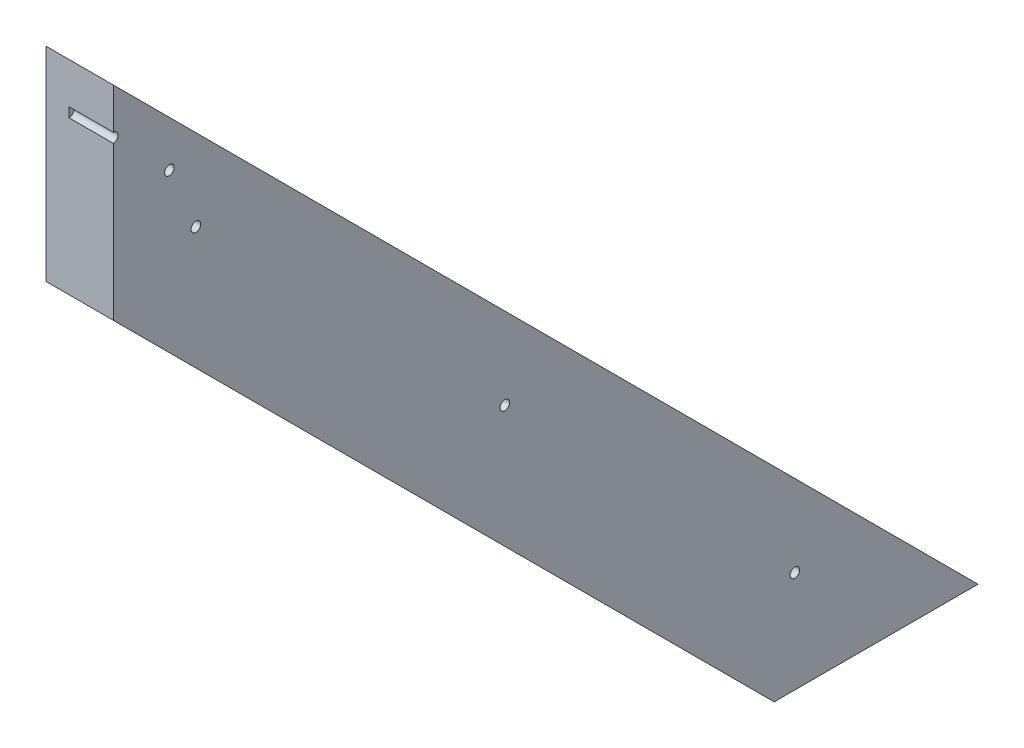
ISO-10303-21;
HEADER;
FILE_DESCRIPTION(('STEP AP214'),'2;1');
FILE_NAME('part.step','',(''),(''),'','','');
FILE_SCHEMA(('AUTOMOTIVE_DESIGN { 1 0 10303 214 1 1 1 1 }'));
ENDSEC;
DATA;
#1=APPLICATION_CONTEXT('core data for automotive mechanical design processes');
#2=APPLICATION_PROTOCOL_DEFINITION('international standard','automotive_design',2000,#1);
#3=PRODUCT_CONTEXT('',#1,'mechanical');
#4=PRODUCT('Part','Part','',(#3));
#5=PRODUCT_RELATED_PRODUCT_CATEGORY('part','',(#4));
#6=PRODUCT_DEFINITION_FORMATION('','',#4);
#7=PRODUCT_DEFINITION_CONTEXT('part definition',#1,'design');
#8=PRODUCT_DEFINITION('design','',#6,#7);
#9=PRODUCT_DEFINITION_SHAPE('','',#8);
#10=(LENGTH_UNIT() NAMED_UNIT(*) SI_UNIT(.MILLI.,.METRE.));
#11=(NAMED_UNIT(*) PLANE_ANGLE_UNIT() SI_UNIT($,.RADIAN.));
#12=(NAMED_UNIT(*) SI_UNIT($,.STERADIAN.) SOLID_ANGLE_UNIT());
#13=UNCERTAINTY_MEASURE_WITH_UNIT(LENGTH_MEASURE(1.E-05),#10,'distance_accuracy_value','');
#14=(GEOMETRIC_REPRESENTATION_CONTEXT(3) GLOBAL_UNCERTAINTY_ASSIGNED_CONTEXT((#13)) GLOBAL_UNIT_ASSIGNED_CONTEXT((#10,
#11,#12)) REPRESENTATION_CONTEXT('',''));
#15=CARTESIAN_POINT('',(0.,0.,0.));
#16=DIRECTION('',(0.,0.,1.));
#17=DIRECTION('',(1.,0.,0.));
#18=AXIS2_PLACEMENT_3D('',#15,#16,#17);
#19=CARTESIAN_POINT('',(-11.684,554.422308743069,-426.863096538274));
#20=DIRECTION('',(1.,0.,0.));
#21=DIRECTION('',(0.,0.,-1.));
#22=AXIS2_PLACEMENT_3D('',#19,#20,#21);
#23=PLANE('',#22);
#24=CARTESIAN_POINT('',(-11.684,554.422308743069,-426.863096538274));
#25=DIRECTION('',(1.,0.,0.));
#26=DIRECTION('',(0.,0.,-1.));
#27=AXIS2_PLACEMENT_3D('',#24,#25,#26);
#28=CIRCLE('',#27,1.26999999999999);
#29=CARTESIAN_POINT('',(-11.684,554.422308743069,-428.133096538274));
#30=VERTEX_POINT('',#29);
#31=EDGE_CURVE('E18',#30,#30,#28,.T.);
#32=ORIENTED_EDGE('',*,*,#31,.T.);
#33=EDGE_LOOP('',(#32));
#34=FACE_BOUND('',#33,.T.);
#35=ADVANCED_FACE('F15',(#34),#23,.T.);
#36=CARTESIAN_POINT('',(-9.398,379.598463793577,-592.236510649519));
#37=DIRECTION('',(1.,0.,0.));
#38=DIRECTION('',(0.,0.,-1.));
#39=AXIS2_PLACEMENT_3D('',#36,#37,#38);
#40=PLANE('',#39);
#41=CARTESIAN_POINT('',(-9.398,379.598463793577,-592.236510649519));
#42=DIRECTION('',(1.,0.,0.));
#43=DIRECTION('',(0.,0.,-1.));
#44=AXIS2_PLACEMENT_3D('',#41,#42,#43);
#45=CIRCLE('',#44,1.26999999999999);
#46=CARTESIAN_POINT('',(-9.398,379.598463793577,-593.506510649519));
#47=VERTEX_POINT('',#46);
#48=EDGE_CURVE('E152',#47,#47,#45,.T.);
#49=ORIENTED_EDGE('',*,*,#48,.T.);
#50=EDGE_LOOP('',(#49));
#51=FACE_BOUND('',#50,.T.);
#52=ADVANCED_FACE('F218',(#51),#40,.T.);
#53=CARTESIAN_POINT('',(-9.398,456.27590464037,-515.559069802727));
#54=DIRECTION('',(1.,0.,0.));
#55=DIRECTION('',(0.,0.,-1.));
#56=AXIS2_PLACEMENT_3D('',#53,#54,#55);
#57=PLANE('',#56);
#58=CARTESIAN_POINT('',(-9.398,456.27590464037,-515.559069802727));
#59=DIRECTION('',(1.,0.,0.));
#60=DIRECTION('',(0.,0.,-1.));
#61=AXIS2_PLACEMENT_3D('',#58,#59,#60);
#62=CIRCLE('',#61,1.26999999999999);
#63=CARTESIAN_POINT('',(-9.398,456.27590464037,-516.829069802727));
#64=VERTEX_POINT('',#63);
#65=EDGE_CURVE('E150',#64,#64,#62,.T.);
#66=ORIENTED_EDGE('',*,*,#65,.T.);
#67=EDGE_LOOP('',(#66));
#68=FACE_BOUND('',#67,.T.);
#69=ADVANCED_FACE('F174',(#68),#57,.T.);
#70=CARTESIAN_POINT('',(-9.398,537.948679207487,-433.88629523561));
#71=DIRECTION('',(1.,0.,0.));
#72=DIRECTION('',(0.,0.,-1.));
#73=AXIS2_PLACEMENT_3D('',#70,#71,#72);
#74=PLANE('',#73);
#75=CARTESIAN_POINT('',(-9.398,537.948679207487,-433.88629523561));
#76=DIRECTION('',(1.,0.,0.));
#77=DIRECTION('',(0.,0.,-1.));
#78=AXIS2_PLACEMENT_3D('',#75,#76,#77);
#79=CIRCLE('',#78,1.26999999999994);
#80=CARTESIAN_POINT('',(-9.398,537.948679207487,-435.15629523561));
#81=VERTEX_POINT('',#80);
#82=EDGE_CURVE('E75',#81,#81,#79,.T.);
#83=ORIENTED_EDGE('',*,*,#82,.T.);
#84=EDGE_LOOP('',(#83));
#85=FACE_BOUND('',#84,.T.);
#86=ADVANCED_FACE('F163',(#85),#74,.T.);
#87=CARTESIAN_POINT('',(-11.684,554.422308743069,-426.863096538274));
#88=DIRECTION('',(1.,0.,0.));
#89=DIRECTION('',(0.,0.,-1.));
#90=AXIS2_PLACEMENT_3D('',#87,#88,#89);
#91=CYLINDRICAL_SURFACE('',#90,1.26999999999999);
#92=CARTESIAN_POINT('',(0.,554.422308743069,-426.863096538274));
#93=DIRECTION('',(1.,0.,0.));
#94=DIRECTION('',(0.,0.,-1.));
#95=AXIS2_PLACEMENT_3D('',#92,#93,#94);
#96=CIRCLE('',#95,1.26999999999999);
#97=CARTESIAN_POINT('',(0.,554.422308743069,-428.133096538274));
#98=VERTEX_POINT('',#97);
#99=EDGE_CURVE('E74',#98,#98,#96,.T.);
#100=ORIENTED_EDGE('',*,*,#99,.T.);
#101=EDGE_LOOP('',(#100));
#102=FACE_BOUND('',#101,.T.);
#103=ORIENTED_EDGE('',*,*,#31,.F.);
#104=EDGE_LOOP('',(#103));
#105=FACE_BOUND('',#104,.T.);
#106=ADVANCED_FACE('F160',(#102,#105),#91,.F.);
#107=CARTESIAN_POINT('',(-9.398,379.598463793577,-592.236510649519));
#108=DIRECTION('',(1.,0.,0.));
#109=DIRECTION('',(0.,0.,-1.));
#110=AXIS2_PLACEMENT_3D('',#107,#108,#109);
#111=CYLINDRICAL_SURFACE('',#110,1.26999999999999);
#112=CARTESIAN_POINT('',(0.,379.598463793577,-592.236510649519));
#113=DIRECTION('',(1.,0.,0.));
#114=DIRECTION('',(0.,0.,-1.));
#115=AXIS2_PLACEMENT_3D('',#112,#113,#114);
#116=CIRCLE('',#115,1.26999999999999);
#117=CARTESIAN_POINT('',(0.,379.598463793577,-593.506510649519));
#118=VERTEX_POINT('',#117);
#119=EDGE_CURVE('E143',#118,#118,#116,.T.);
#120=ORIENTED_EDGE('',*,*,#119,.T.);
#121=EDGE_LOOP('',(#120));
#122=FACE_BOUND('',#121,.T.);
#123=ORIENTED_EDGE('',*,*,#48,.F.);
#124=EDGE_LOOP('',(#123));
#125=FACE_BOUND('',#124,.T.);
#126=ADVANCED_FACE('F162',(#122,#125),#111,.F.);
#127=CARTESIAN_POINT('',(-9.398,456.27590464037,-515.559069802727));
#128=DIRECTION('',(1.,0.,0.));
#129=DIRECTION('',(0.,0.,-1.));
#130=AXIS2_PLACEMENT_3D('',#127,#128,#129);
#131=CYLINDRICAL_SURFACE('',#130,1.26999999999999);
#132=CARTESIAN_POINT('',(0.,456.27590464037,-515.559069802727));
#133=DIRECTION('',(1.,0.,0.));
#134=DIRECTION('',(0.,0.,-1.));
#135=AXIS2_PLACEMENT_3D('',#132,#133,#134);
#136=CIRCLE('',#135,1.26999999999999);
#137=CARTESIAN_POINT('',(0.,456.27590464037,-516.829069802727));
#138=VERTEX_POINT('',#137);
#139=EDGE_CURVE('E140',#138,#138,#136,.T.);
#140=ORIENTED_EDGE('',*,*,#139,.T.);
#141=EDGE_LOOP('',(#140));
#142=FACE_BOUND('',#141,.T.);
#143=ORIENTED_EDGE('',*,*,#65,.F.);
#144=EDGE_LOOP('',(#143));
#145=FACE_BOUND('',#144,.T.);
#146=ADVANCED_FACE('F171',(#142,#145),#131,.F.);
#147=CARTESIAN_POINT('',(-9.398,537.948679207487,-433.88629523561));
#148=DIRECTION('',(1.,0.,0.));
#149=DIRECTION('',(0.,0.,-1.));
#150=AXIS2_PLACEMENT_3D('',#147,#148,#149);
#151=CYLINDRICAL_SURFACE('',#150,1.26999999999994);
#152=CARTESIAN_POINT('',(0.,537.948679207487,-433.88629523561));
#153=DIRECTION('',(1.,0.,0.));
#154=DIRECTION('',(0.,0.,-1.));
#155=AXIS2_PLACEMENT_3D('',#152,#153,#154);
#156=CIRCLE('',#155,1.26999999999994);
#157=CARTESIAN_POINT('',(0.,537.948679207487,-435.15629523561));
#158=VERTEX_POINT('',#157);
#159=EDGE_CURVE('E137',#158,#158,#156,.T.);
#160=ORIENTED_EDGE('',*,*,#159,.T.);
#161=EDGE_LOOP('',(#160));
#162=FACE_BOUND('',#161,.T.);
#163=ORIENTED_EDGE('',*,*,#82,.F.);
#164=EDGE_LOOP('',(#163));
#165=FACE_BOUND('',#164,.T.);
#166=ADVANCED_FACE('F205',(#162,#165),#151,.F.);
#167=CARTESIAN_POINT('',(-11.684,569.250028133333,-412.03537714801));
#168=DIRECTION('',(1.,0.,0.));
#169=DIRECTION('',(0.,0.,-1.));
#170=AXIS2_PLACEMENT_3D('',#167,#168,#169);
#171=PLANE('',#170);
#172=CARTESIAN_POINT('',(-11.684,569.250028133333,-412.03537714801));
#173=DIRECTION('',(1.,0.,0.));
#174=DIRECTION('',(0.,0.,-1.));
#175=AXIS2_PLACEMENT_3D('',#172,#173,#174);
#176=CIRCLE('',#175,1.26999999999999);
#177=CARTESIAN_POINT('',(-11.684,567.980028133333,-412.03537714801));
#178=VERTEX_POINT('',#177);
#179=CARTESIAN_POINT('',(-11.684,570.520028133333,-412.03537714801));
#180=VERTEX_POINT('',#179);
#181=EDGE_CURVE('E63',#178,#180,#176,.T.);
#182=ORIENTED_EDGE('',*,*,#181,.T.);
#183=DIRECTION('',(0.,1.,0.));
#184=VECTOR('',#183,1.);
#185=CARTESIAN_POINT('',(-11.684,0.,-412.03537714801));
#186=LINE('',#185,#184);
#187=EDGE_CURVE('E77',#178,#180,#186,.T.);
#188=ORIENTED_EDGE('',*,*,#187,.F.);
#189=EDGE_LOOP('',(#182,#188));
#190=FACE_BOUND('',#189,.T.);
#191=ADVANCED_FACE('F78',(#190),#171,.T.);
#192=CARTESIAN_POINT('',(-11.684,569.250028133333,-412.03537714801));
#193=DIRECTION('',(1.,0.,0.));
#194=DIRECTION('',(0.,0.,-1.));
#195=AXIS2_PLACEMENT_3D('',#192,#193,#194);
#196=CYLINDRICAL_SURFACE('',#195,1.26999999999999);
#197=ORIENTED_EDGE('',*,*,#181,.F.);
#198=DIRECTION('',(1.,0.,0.));
#199=VECTOR('',#198,1.);
#200=CARTESIAN_POINT('',(-17.78,567.980028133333,-412.03537714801));
#201=LINE('',#200,#199);
#202=CARTESIAN_POINT('',(0.,567.980028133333,-412.03537714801));
#203=VERTEX_POINT('',#202);
#204=EDGE_CURVE('E69',#203,#178,#201,.F.);
#205=ORIENTED_EDGE('',*,*,#204,.F.);
#206=CARTESIAN_POINT('',(0.,569.250028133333,-412.03537714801));
#207=DIRECTION('',(1.,0.,0.));
#208=DIRECTION('',(0.,0.,-1.));
#209=AXIS2_PLACEMENT_3D('',#206,#207,#208);
#210=CIRCLE('',#209,1.26999999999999);
#211=CARTESIAN_POINT('',(0.,570.520028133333,-412.03537714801));
#212=VERTEX_POINT('',#211);
#213=EDGE_CURVE('E124',#203,#212,#210,.T.);
#214=ORIENTED_EDGE('',*,*,#213,.T.);
#215=DIRECTION('',(1.,0.,0.));
#216=VECTOR('',#215,1.);
#217=CARTESIAN_POINT('',(-17.78,570.520028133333,-412.03537714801));
#218=LINE('',#217,#216);
#219=EDGE_CURVE('E72',#180,#212,#218,.T.);
#220=ORIENTED_EDGE('',*,*,#219,.F.);
#221=EDGE_LOOP('',(#197,#205,#214,#220));
#222=FACE_BOUND('',#221,.T.);
#223=ADVANCED_FACE('F67',(#222),#196,.F.);
#224=CARTESIAN_POINT('',(0.,0.,0.));
#225=DIRECTION('',(-1.,0.,0.));
#226=DIRECTION('',(0.,0.,1.));
#227=AXIS2_PLACEMENT_3D('',#224,#225,#226);
#228=PLANE('',#227);
#229=DIRECTION('',(0.,0.,1.));
#230=VECTOR('',#229,1.);
#231=CARTESIAN_POINT('',(0.,352.752211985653,-3.63420989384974E-13));
#232=LINE('',#231,#230);
#233=CARTESIAN_POINT('',(0.,352.752211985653,-586.753840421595));
#234=VERTEX_POINT('',#233);
#235=CARTESIAN_POINT('',(0.,352.752211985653,-640.635377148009));
#236=VERTEX_POINT('',#235);
#237=EDGE_CURVE('E123',#234,#236,#232,.F.);
#238=ORIENTED_EDGE('',*,*,#237,.T.);
#239=DIRECTION('',(0.,-0.707106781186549,-0.707106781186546));
#240=VECTOR('',#239,1.);
#241=CARTESIAN_POINT('',(0.,496.69379456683,-496.693794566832));
#242=LINE('',#241,#240);
#243=CARTESIAN_POINT('',(0.,581.352211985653,-412.03537714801));
#244=VERTEX_POINT('',#243);
#245=EDGE_CURVE('E121',#236,#244,#242,.F.);
#246=ORIENTED_EDGE('',*,*,#245,.T.);
#247=DIRECTION('',(0.,1.,0.));
#248=VECTOR('',#247,1.);
#249=CARTESIAN_POINT('',(0.,0.,-412.03537714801));
#250=LINE('',#249,#248);
#251=EDGE_CURVE('E112',#212,#244,#250,.T.);
#252=ORIENTED_EDGE('',*,*,#251,.F.);
#253=ORIENTED_EDGE('',*,*,#213,.F.);
#254=DIRECTION('',(0.,1.,0.));
#255=VECTOR('',#254,1.);
#256=CARTESIAN_POINT('',(0.,0.,-412.03537714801));
#257=LINE('',#256,#255);
#258=CARTESIAN_POINT('',(0.,527.470675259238,-412.03537714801));
#259=VERTEX_POINT('',#258);
#260=EDGE_CURVE('E83',#259,#203,#257,.T.);
#261=ORIENTED_EDGE('',*,*,#260,.F.);
#262=DIRECTION('',(0.,-0.707106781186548,-0.707106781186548));
#263=VECTOR('',#262,1.);
#264=CARTESIAN_POINT('',(0.,469.753026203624,-469.753026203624));
#265=LINE('',#264,#263);
#266=EDGE_CURVE('E87',#234,#259,#265,.F.);
#267=ORIENTED_EDGE('',*,*,#266,.F.);
#268=EDGE_LOOP('',(#238,#246,#252,#253,#261,#267));
#269=FACE_BOUND('',#268,.T.);
#270=ORIENTED_EDGE('',*,*,#159,.F.);
#271=EDGE_LOOP('',(#270));
#272=FACE_BOUND('',#271,.T.);
#273=ORIENTED_EDGE('',*,*,#139,.F.);
#274=EDGE_LOOP('',(#273));
#275=FACE_BOUND('',#274,.T.);
#276=ORIENTED_EDGE('',*,*,#119,.F.);
#277=EDGE_LOOP('',(#276));
#278=FACE_BOUND('',#277,.T.);
#279=ORIENTED_EDGE('',*,*,#99,.F.);
#280=EDGE_LOOP('',(#279));
#281=FACE_BOUND('',#280,.T.);
#282=ADVANCED_FACE('F196',(#269,#272,#275,#278,#281),#228,.F.);
#283=CARTESIAN_POINT('',(-17.78,496.69379456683,-496.693794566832));
#284=DIRECTION('',(0.,-0.707106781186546,0.707106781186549));
#285=DIRECTION('',(0.,-0.707106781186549,-0.707106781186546));
#286=AXIS2_PLACEMENT_3D('',#283,#284,#285);
#287=PLANE('',#286);
#288=DIRECTION('',(1.,0.,0.));
#289=VECTOR('',#288,1.);
#290=CARTESIAN_POINT('',(-17.78,352.752211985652,-640.635377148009));
#291=LINE('',#290,#289);
#292=CARTESIAN_POINT('',(-17.78,352.752211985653,-640.635377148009));
#293=VERTEX_POINT('',#292);
#294=EDGE_CURVE('E101',#236,#293,#291,.F.);
#295=ORIENTED_EDGE('',*,*,#294,.T.);
#296=DIRECTION('',(0.,-0.707106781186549,-0.707106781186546));
#297=VECTOR('',#296,1.);
#298=CARTESIAN_POINT('',(-17.78,581.352211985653,-412.03537714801));
#299=LINE('',#298,#297);
#300=CARTESIAN_POINT('',(-17.78,581.352211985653,-412.03537714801));
#301=VERTEX_POINT('',#300);
#302=EDGE_CURVE('E91',#301,#293,#299,.T.);
#303=ORIENTED_EDGE('',*,*,#302,.F.);
#304=DIRECTION('',(1.,0.,0.));
#305=VECTOR('',#304,1.);
#306=CARTESIAN_POINT('',(-17.78,581.352211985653,-412.03537714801));
#307=LINE('',#306,#305);
#308=EDGE_CURVE('E97',#244,#301,#307,.F.);
#309=ORIENTED_EDGE('',*,*,#308,.F.);
#310=ORIENTED_EDGE('',*,*,#245,.F.);
#311=EDGE_LOOP('',(#295,#303,#309,#310));
#312=FACE_BOUND('',#311,.T.);
#313=ADVANCED_FACE('F192',(#312),#287,.F.);
#314=CARTESIAN_POINT('',(-17.78,352.752211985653,-3.63420989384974E-13));
#315=DIRECTION('',(0.,1.,0.));
#316=DIRECTION('',(0.,0.,1.));
#317=AXIS2_PLACEMENT_3D('',#314,#315,#316);
#318=PLANE('',#317);
#319=ORIENTED_EDGE('',*,*,#294,.F.);
#320=ORIENTED_EDGE('',*,*,#237,.F.);
#321=DIRECTION('',(1.,0.,0.));
#322=VECTOR('',#321,1.);
#323=CARTESIAN_POINT('',(-17.78,352.752211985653,-586.753840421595));
#324=LINE('',#323,#322);
#325=CARTESIAN_POINT('',(-17.78,352.752211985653,-586.753840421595));
#326=VERTEX_POINT('',#325);
#327=EDGE_CURVE('E84',#326,#234,#324,.T.);
#328=ORIENTED_EDGE('',*,*,#327,.F.);
#329=DIRECTION('',(0.,0.,1.));
#330=VECTOR('',#329,1.);
#331=CARTESIAN_POINT('',(-17.78,352.752211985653,0.));
#332=LINE('',#331,#330);
#333=EDGE_CURVE('E108',#293,#326,#332,.T.);
#334=ORIENTED_EDGE('',*,*,#333,.F.);
#335=EDGE_LOOP('',(#319,#320,#328,#334));
#336=FACE_BOUND('',#335,.T.);
#337=ADVANCED_FACE('F189',(#336),#318,.F.);
#338=CARTESIAN_POINT('',(-17.78,469.753026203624,-469.753026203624));
#339=DIRECTION('',(0.,-0.707106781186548,0.707106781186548));
#340=DIRECTION('',(0.,-0.707106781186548,-0.707106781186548));
#341=AXIS2_PLACEMENT_3D('',#338,#339,#340);
#342=PLANE('',#341);
#343=DIRECTION('',(0.,0.707106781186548,0.707106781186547));
#344=VECTOR('',#343,1.);
#345=CARTESIAN_POINT('',(-17.78,352.752211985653,-586.753840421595));
#346=LINE('',#345,#344);
#347=CARTESIAN_POINT('',(-17.78,527.470675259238,-412.03537714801));
#348=VERTEX_POINT('',#347);
#349=EDGE_CURVE('E24',#326,#348,#346,.T.);
#350=ORIENTED_EDGE('',*,*,#349,.F.);
#351=ORIENTED_EDGE('',*,*,#327,.T.);
#352=ORIENTED_EDGE('',*,*,#266,.T.);
#353=DIRECTION('',(1.,0.,0.));
#354=VECTOR('',#353,1.);
#355=CARTESIAN_POINT('',(-17.78,527.470675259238,-412.03537714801));
#356=LINE('',#355,#354);
#357=EDGE_CURVE('E33',#348,#259,#356,.T.);
#358=ORIENTED_EDGE('',*,*,#357,.F.);
#359=EDGE_LOOP('',(#350,#351,#352,#358));
#360=FACE_BOUND('',#359,.T.);
#361=ADVANCED_FACE('F184',(#360),#342,.T.);
#362=CARTESIAN_POINT('',(-17.78,0.,-412.03537714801));
#363=DIRECTION('',(0.,0.,1.));
#364=DIRECTION('',(1.,0.,0.));
#365=AXIS2_PLACEMENT_3D('',#362,#363,#364);
#366=PLANE('',#365);
#367=ORIENTED_EDGE('',*,*,#357,.T.);
#368=ORIENTED_EDGE('',*,*,#260,.T.);
#369=ORIENTED_EDGE('',*,*,#204,.T.);
#370=ORIENTED_EDGE('',*,*,#187,.T.);
#371=ORIENTED_EDGE('',*,*,#219,.T.);
#372=ORIENTED_EDGE('',*,*,#251,.T.);
#373=ORIENTED_EDGE('',*,*,#308,.T.);
#374=DIRECTION('',(0.,1.,0.));
#375=VECTOR('',#374,1.);
#376=CARTESIAN_POINT('',(-17.78,0.,-412.03537714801));
#377=LINE('',#376,#375);
#378=EDGE_CURVE('E9',#348,#301,#377,.T.);
#379=ORIENTED_EDGE('',*,*,#378,.F.);
#380=EDGE_LOOP('',(#367,#368,#369,#370,#371,#372,#373,#379));
#381=FACE_BOUND('',#380,.T.);
#382=ADVANCED_FACE('F81',(#381),#366,.T.);
#383=CARTESIAN_POINT('',(-17.78,0.,0.));
#384=DIRECTION('',(-1.,0.,0.));
#385=DIRECTION('',(0.,0.,1.));
#386=AXIS2_PLACEMENT_3D('',#383,#384,#385);
#387=PLANE('',#386);
#388=ORIENTED_EDGE('',*,*,#349,.T.);
#389=ORIENTED_EDGE('',*,*,#378,.T.);
#390=ORIENTED_EDGE('',*,*,#302,.T.);
#391=ORIENTED_EDGE('',*,*,#333,.T.);
#392=EDGE_LOOP('',(#388,#389,#390,#391));
#393=FACE_BOUND('',#392,.T.);
#394=ADVANCED_FACE('F177',(#393),#387,.T.);
#395=CLOSED_SHELL('',(#35,#52,#69,#86,#106,#126,#146,#166,#191,#223,#282,#313,#337,#361,#382,#394));
#396=MANIFOLD_SOLID_BREP('B1',#395);
#397=ADVANCED_BREP_SHAPE_REPRESENTATION('',(#18,#396),#14);
#398=SHAPE_DEFINITION_REPRESENTATION(#9,#397);
ENDSEC;
END-ISO-10303-21;
